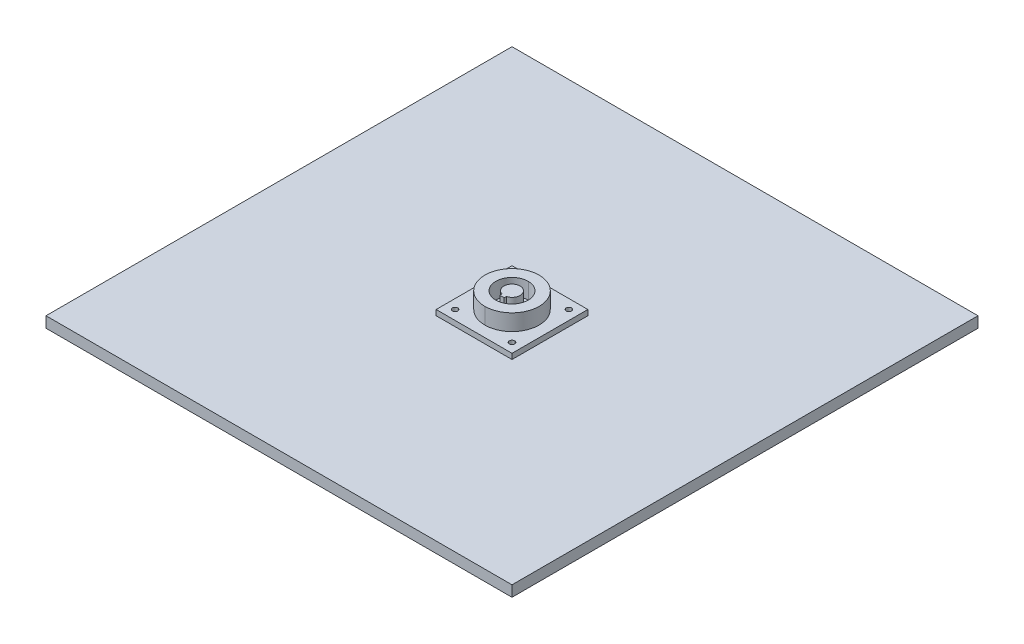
ISO-10303-21;
HEADER;
FILE_DESCRIPTION(('STEP AP214'),'2;1');
FILE_NAME('part.step','',(''),(''),'','','');
FILE_SCHEMA(('AUTOMOTIVE_DESIGN { 1 0 10303 214 1 1 1 1 }'));
ENDSEC;
DATA;
#1=APPLICATION_CONTEXT('core data for automotive mechanical design processes');
#2=APPLICATION_PROTOCOL_DEFINITION('international standard','automotive_design',2000,#1);
#3=PRODUCT_CONTEXT('',#1,'mechanical');
#4=PRODUCT('Part','Part','',(#3));
#5=PRODUCT_RELATED_PRODUCT_CATEGORY('part','',(#4));
#6=PRODUCT_DEFINITION_FORMATION('','',#4);
#7=PRODUCT_DEFINITION_CONTEXT('part definition',#1,'design');
#8=PRODUCT_DEFINITION('design','',#6,#7);
#9=PRODUCT_DEFINITION_SHAPE('','',#8);
#10=(LENGTH_UNIT() NAMED_UNIT(*) SI_UNIT(.MILLI.,.METRE.));
#11=(NAMED_UNIT(*) PLANE_ANGLE_UNIT() SI_UNIT($,.RADIAN.));
#12=(NAMED_UNIT(*) SI_UNIT($,.STERADIAN.) SOLID_ANGLE_UNIT());
#13=UNCERTAINTY_MEASURE_WITH_UNIT(LENGTH_MEASURE(1.E-05),#10,'distance_accuracy_value','');
#14=(GEOMETRIC_REPRESENTATION_CONTEXT(3) GLOBAL_UNCERTAINTY_ASSIGNED_CONTEXT((#13)) GLOBAL_UNIT_ASSIGNED_CONTEXT((#10,
#11,#12)) REPRESENTATION_CONTEXT('',''));
#15=CARTESIAN_POINT('',(0.,0.,0.));
#16=DIRECTION('',(0.,0.,1.));
#17=DIRECTION('',(1.,0.,0.));
#18=AXIS2_PLACEMENT_3D('',#15,#16,#17);
#19=CARTESIAN_POINT('',(-35.,5.,-35.));
#20=DIRECTION('',(0.,1.,0.));
#21=DIRECTION('',(0.,0.,1.));
#22=AXIS2_PLACEMENT_3D('',#19,#20,#21);
#23=PLANE('',#22);
#24=CARTESIAN_POINT('',(-35.,5.,35.));
#25=DIRECTION('',(1.,0.,0.));
#26=VECTOR('',#25,1.);
#27=LINE('',#24,#26);
#28=CARTESIAN_POINT('',(-35.,5.,35.));
#29=VERTEX_POINT('',#28);
#30=CARTESIAN_POINT('',(35.,5.,35.));
#31=VERTEX_POINT('',#30);
#32=EDGE_CURVE('E11',#29,#31,#27,.T.);
#33=ORIENTED_EDGE('',*,*,#32,.T.);
#34=CARTESIAN_POINT('',(35.,5.,35.));
#35=DIRECTION('',(0.,0.,-1.));
#36=VECTOR('',#35,1.);
#37=LINE('',#34,#36);
#38=CARTESIAN_POINT('',(35.,5.,-35.));
#39=VERTEX_POINT('',#38);
#40=EDGE_CURVE('E25',#31,#39,#37,.T.);
#41=ORIENTED_EDGE('',*,*,#40,.T.);
#42=CARTESIAN_POINT('',(-35.,5.,-35.));
#43=DIRECTION('',(1.,0.,0.));
#44=VECTOR('',#43,1.);
#45=LINE('',#42,#44);
#46=CARTESIAN_POINT('',(-35.,5.,-35.));
#47=VERTEX_POINT('',#46);
#48=EDGE_CURVE('E620',#47,#39,#45,.T.);
#49=ORIENTED_EDGE('',*,*,#48,.F.);
#50=CARTESIAN_POINT('',(-35.,5.,35.));
#51=DIRECTION('',(0.,0.,-1.));
#52=VECTOR('',#51,1.);
#53=LINE('',#50,#52);
#54=EDGE_CURVE('E617',#29,#47,#53,.T.);
#55=ORIENTED_EDGE('',*,*,#54,.F.);
#56=EDGE_LOOP('',(#33,#41,#49,#55));
#57=FACE_BOUND('',#56,.T.);
#58=CARTESIAN_POINT('',(0.,5.,0.));
#59=DIRECTION('',(0.,1.,0.));
#60=DIRECTION('',(0.,0.,-1.));
#61=AXIS2_PLACEMENT_3D('',#58,#59,#60);
#62=CIRCLE('',#61,25.);
#63=CARTESIAN_POINT('',(0.,5.,-25.));
#64=VERTEX_POINT('',#63);
#65=CARTESIAN_POINT('',(0.,5.,25.));
#66=VERTEX_POINT('',#65);
#67=EDGE_CURVE('E614',#64,#66,#62,.T.);
#68=ORIENTED_EDGE('',*,*,#67,.F.);
#69=CARTESIAN_POINT('',(0.,5.,0.));
#70=DIRECTION('',(0.,1.,0.));
#71=DIRECTION('',(0.,0.,1.));
#72=AXIS2_PLACEMENT_3D('',#69,#70,#71);
#73=CIRCLE('',#72,25.);
#74=EDGE_CURVE('E611',#66,#64,#73,.T.);
#75=ORIENTED_EDGE('',*,*,#74,.F.);
#76=EDGE_LOOP('',(#68,#75));
#77=FACE_BOUND('',#76,.T.);
#78=CARTESIAN_POINT('',(-26.2566311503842,5.,-26.2566311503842));
#79=DIRECTION('',(0.,1.,0.));
#80=DIRECTION('',(0.,0.,-1.));
#81=AXIS2_PLACEMENT_3D('',#78,#79,#80);
#82=CIRCLE('',#81,2.5);
#83=CARTESIAN_POINT('',(-26.2566311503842,5.,-28.7566311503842));
#84=VERTEX_POINT('',#83);
#85=CARTESIAN_POINT('',(-26.2566311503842,5.,-23.7566311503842));
#86=VERTEX_POINT('',#85);
#87=EDGE_CURVE('E608',#84,#86,#82,.T.);
#88=ORIENTED_EDGE('',*,*,#87,.F.);
#89=CARTESIAN_POINT('',(-26.2566311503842,5.,-26.2566311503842));
#90=DIRECTION('',(0.,1.,0.));
#91=DIRECTION('',(0.,0.,1.));
#92=AXIS2_PLACEMENT_3D('',#89,#90,#91);
#93=CIRCLE('',#92,2.5);
#94=EDGE_CURVE('E605',#86,#84,#93,.T.);
#95=ORIENTED_EDGE('',*,*,#94,.F.);
#96=EDGE_LOOP('',(#88,#95));
#97=FACE_BOUND('',#96,.T.);
#98=CARTESIAN_POINT('',(26.2566311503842,5.,-26.2566311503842));
#99=DIRECTION('',(0.,1.,0.));
#100=DIRECTION('',(0.,0.,-1.));
#101=AXIS2_PLACEMENT_3D('',#98,#99,#100);
#102=CIRCLE('',#101,2.5);
#103=CARTESIAN_POINT('',(26.2566311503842,5.,-28.7566311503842));
#104=VERTEX_POINT('',#103);
#105=CARTESIAN_POINT('',(26.2566311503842,5.,-23.7566311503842));
#106=VERTEX_POINT('',#105);
#107=EDGE_CURVE('E602',#104,#106,#102,.T.);
#108=ORIENTED_EDGE('',*,*,#107,.F.);
#109=CARTESIAN_POINT('',(26.2566311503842,5.,-26.2566311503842));
#110=DIRECTION('',(0.,1.,0.));
#111=DIRECTION('',(0.,0.,1.));
#112=AXIS2_PLACEMENT_3D('',#109,#110,#111);
#113=CIRCLE('',#112,2.5);
#114=EDGE_CURVE('E599',#106,#104,#113,.T.);
#115=ORIENTED_EDGE('',*,*,#114,.F.);
#116=EDGE_LOOP('',(#108,#115));
#117=FACE_BOUND('',#116,.T.);
#118=CARTESIAN_POINT('',(-26.2566311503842,5.,28.7566311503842));
#119=CARTESIAN_POINT('',(-26.7120474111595,5.,28.7564461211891));
#120=CARTESIAN_POINT('',(-27.1581460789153,5.,28.6325485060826));
#121=CARTESIAN_POINT('',(-27.9255362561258,5.,28.1694266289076));
#122=CARTESIAN_POINT('',(-28.2362183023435,5.,27.8457188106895));
#123=CARTESIAN_POINT('',(-28.7376288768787,5.,26.9323547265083));
#124=CARTESIAN_POINT('',(-28.8272007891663,5.,26.3184998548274));
#125=CARTESIAN_POINT('',(-28.6206181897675,5.,25.3582328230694));
#126=CARTESIAN_POINT('',(-28.4564020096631,5.,25.0092356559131));
#127=CARTESIAN_POINT('',(-27.8276854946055,5.,24.210965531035));
#128=CARTESIAN_POINT('',(-27.2598969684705,5.,23.8802386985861));
#129=CARTESIAN_POINT('',(-26.5075682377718,5.,23.766136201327));
#130=CARTESIAN_POINT('',(-26.3821872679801,5.,23.7566821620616));
#131=CARTESIAN_POINT('',(-26.2566311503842,5.,23.7566311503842));
#132=B_SPLINE_CURVE_WITH_KNOTS('',3,(#118,#119,#120,#121,#122,#123,#124,#125,#126,#127,#128,
#129,#130,#131),.UNSPECIFIED.,.F.,.F.,(4,2,2,2,2,2,4),(0.,0.172601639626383,0.339653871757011,
0.56746654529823,0.711758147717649,0.952421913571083,1.),.UNSPECIFIED.);
#133=CARTESIAN_POINT('',(-26.2566311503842,5.,28.7566311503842));
#134=VERTEX_POINT('',#133);
#135=CARTESIAN_POINT('',(-26.2566311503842,5.,23.7566311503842));
#136=VERTEX_POINT('',#135);
#137=EDGE_CURVE('E597',#134,#136,#132,.T.);
#138=ORIENTED_EDGE('',*,*,#137,.T.);
#139=CARTESIAN_POINT('',(-26.2566311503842,5.,23.7566311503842));
#140=CARTESIAN_POINT('',(-25.8012148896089,5.,23.7568161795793));
#141=CARTESIAN_POINT('',(-25.3551162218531,5.,23.8807137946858));
#142=CARTESIAN_POINT('',(-24.5877260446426,5.,24.3438356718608));
#143=CARTESIAN_POINT('',(-24.2770439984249,5.,24.667543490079));
#144=CARTESIAN_POINT('',(-23.7756334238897,5.,25.58090757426));
#145=CARTESIAN_POINT('',(-23.6860615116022,5.,26.194762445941));
#146=CARTESIAN_POINT('',(-23.8926441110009,5.,27.155029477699));
#147=CARTESIAN_POINT('',(-24.0568602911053,5.,27.5040266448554));
#148=CARTESIAN_POINT('',(-24.6855768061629,5.,28.3022967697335));
#149=CARTESIAN_POINT('',(-25.2533653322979,5.,28.6330236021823));
#150=CARTESIAN_POINT('',(-26.0056940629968,5.,28.7471260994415));
#151=CARTESIAN_POINT('',(-26.1310750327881,5.,28.7565801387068));
#152=CARTESIAN_POINT('',(-26.2566311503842,5.,28.7566311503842));
#153=B_SPLINE_CURVE_WITH_KNOTS('',3,(#139,#140,#141,#142,#143,#144,#145,#146,#147,#148,#149,
#150,#151,#152),.UNSPECIFIED.,.F.,.F.,(4,2,2,2,2,2,4),(0.,0.172601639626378,0.339653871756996,
0.567466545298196,0.711758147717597,0.952421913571,1.),.UNSPECIFIED.);
#154=EDGE_CURVE('E595',#136,#134,#153,.T.);
#155=ORIENTED_EDGE('',*,*,#154,.T.);
#156=EDGE_LOOP('',(#138,#155));
#157=FACE_BOUND('',#156,.T.);
#158=CARTESIAN_POINT('',(26.2566311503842,5.,28.7566311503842));
#159=CARTESIAN_POINT('',(25.8012148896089,5.,28.7564461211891));
#160=CARTESIAN_POINT('',(25.3551162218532,5.,28.6325485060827));
#161=CARTESIAN_POINT('',(24.5877260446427,5.,28.1694266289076));
#162=CARTESIAN_POINT('',(24.2770439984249,5.,27.8457188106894));
#163=CARTESIAN_POINT('',(23.7756334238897,5.,26.9323547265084));
#164=CARTESIAN_POINT('',(23.6860615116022,5.,26.3184998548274));
#165=CARTESIAN_POINT('',(23.892644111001,5.,25.3582328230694));
#166=CARTESIAN_POINT('',(24.0568602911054,5.,25.0092356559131));
#167=CARTESIAN_POINT('',(24.6855768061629,5.,24.2109655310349));
#168=CARTESIAN_POINT('',(25.2533653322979,5.,23.8802386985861));
#169=CARTESIAN_POINT('',(26.0056940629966,5.,23.766136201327));
#170=CARTESIAN_POINT('',(26.1310750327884,5.,23.7566821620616));
#171=CARTESIAN_POINT('',(26.2566311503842,5.,23.7566311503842));
#172=B_SPLINE_CURVE_WITH_KNOTS('',3,(#158,#159,#160,#161,#162,#163,#164,#165,#166,#167,#168,
#169,#170,#171),.UNSPECIFIED.,.F.,.F.,(4,2,2,2,2,2,4),(0.,0.172601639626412,0.339653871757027,
0.567466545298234,0.711758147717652,0.952421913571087,1.),.UNSPECIFIED.);
#173=CARTESIAN_POINT('',(26.2566311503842,5.,28.7566311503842));
#174=VERTEX_POINT('',#173);
#175=CARTESIAN_POINT('',(26.2566311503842,5.,23.7566311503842));
#176=VERTEX_POINT('',#175);
#177=EDGE_CURVE('E593',#174,#176,#172,.T.);
#178=ORIENTED_EDGE('',*,*,#177,.T.);
#179=CARTESIAN_POINT('',(26.2566311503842,5.,23.7566311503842));
#180=CARTESIAN_POINT('',(26.7120474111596,5.,23.7568161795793));
#181=CARTESIAN_POINT('',(27.1581460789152,5.,23.8807137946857));
#182=CARTESIAN_POINT('',(27.9255362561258,5.,24.3438356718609));
#183=CARTESIAN_POINT('',(28.2362183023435,5.,24.6675434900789));
#184=CARTESIAN_POINT('',(28.7376288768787,5.,25.5809075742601));
#185=CARTESIAN_POINT('',(28.8272007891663,5.,26.194762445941));
#186=CARTESIAN_POINT('',(28.6206181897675,5.,27.1550294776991));
#187=CARTESIAN_POINT('',(28.4564020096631,5.,27.5040266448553));
#188=CARTESIAN_POINT('',(27.8276854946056,5.,28.3022967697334));
#189=CARTESIAN_POINT('',(27.2598969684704,5.,28.6330236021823));
#190=CARTESIAN_POINT('',(26.5075682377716,5.,28.7471260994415));
#191=CARTESIAN_POINT('',(26.3821872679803,5.,28.7565801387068));
#192=CARTESIAN_POINT('',(26.2566311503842,5.,28.7566311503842));
#193=B_SPLINE_CURVE_WITH_KNOTS('',3,(#179,#180,#181,#182,#183,#184,#185,#186,#187,#188,#189,
#190,#191,#192),.UNSPECIFIED.,.F.,.F.,(4,2,2,2,2,2,4),(0.,0.172601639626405,0.339653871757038,
0.567466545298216,0.71175814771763,0.952421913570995,1.),.UNSPECIFIED.);
#194=EDGE_CURVE('E591',#176,#174,#193,.T.);
#195=ORIENTED_EDGE('',*,*,#194,.T.);
#196=EDGE_LOOP('',(#178,#195));
#197=FACE_BOUND('',#196,.T.);
#198=ADVANCED_FACE('F16',(#57,#77,#97,#117,#157,#197),#23,.T.);
#199=CARTESIAN_POINT('',(26.2566311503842,5.,26.2566311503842));
#200=DIRECTION('',(0.,-1.,0.));
#201=DIRECTION('',(-1.,0.,0.));
#202=AXIS2_PLACEMENT_3D('',#199,#200,#201);
#203=CYLINDRICAL_SURFACE('',#202,2.49999999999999);
#204=ORIENTED_EDGE('',*,*,#194,.F.);
#205=CARTESIAN_POINT('',(26.2566311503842,5.,23.7566311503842));
#206=DIRECTION('',(0.,-1.,0.));
#207=VECTOR('',#206,1.);
#208=LINE('',#205,#207);
#209=CARTESIAN_POINT('',(26.2566311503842,0.,23.7566311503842));
#210=VERTEX_POINT('',#209);
#211=EDGE_CURVE('E589',#176,#210,#208,.T.);
#212=ORIENTED_EDGE('',*,*,#211,.T.);
#213=CARTESIAN_POINT('',(26.2566311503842,0.,26.2566311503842));
#214=DIRECTION('',(0.,-1.,0.));
#215=DIRECTION('',(0.,0.,-1.));
#216=AXIS2_PLACEMENT_3D('',#213,#214,#215);
#217=CIRCLE('',#216,2.49999999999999);
#218=CARTESIAN_POINT('',(26.2566311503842,0.,28.7566311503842));
#219=VERTEX_POINT('',#218);
#220=EDGE_CURVE('E587',#210,#219,#217,.T.);
#221=ORIENTED_EDGE('',*,*,#220,.T.);
#222=CARTESIAN_POINT('',(26.2566311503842,0.,28.7566311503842));
#223=DIRECTION('',(0.,1.,0.));
#224=VECTOR('',#223,1.);
#225=LINE('',#222,#224);
#226=EDGE_CURVE('E584',#219,#174,#225,.T.);
#227=ORIENTED_EDGE('',*,*,#226,.T.);
#228=EDGE_LOOP('',(#204,#212,#221,#227));
#229=FACE_BOUND('',#228,.T.);
#230=ADVANCED_FACE('F1547',(#229),#203,.F.);
#231=CARTESIAN_POINT('',(26.2566311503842,5.,26.2566311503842));
#232=DIRECTION('',(0.,-1.,0.));
#233=DIRECTION('',(1.,0.,0.));
#234=AXIS2_PLACEMENT_3D('',#231,#232,#233);
#235=CYLINDRICAL_SURFACE('',#234,2.49999999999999);
#236=CARTESIAN_POINT('',(26.2566311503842,0.,26.2566311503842));
#237=DIRECTION('',(0.,-1.,0.));
#238=DIRECTION('',(0.,0.,1.));
#239=AXIS2_PLACEMENT_3D('',#236,#237,#238);
#240=CIRCLE('',#239,2.49999999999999);
#241=EDGE_CURVE('E581',#219,#210,#240,.T.);
#242=ORIENTED_EDGE('',*,*,#241,.T.);
#243=ORIENTED_EDGE('',*,*,#211,.F.);
#244=ORIENTED_EDGE('',*,*,#177,.F.);
#245=ORIENTED_EDGE('',*,*,#226,.F.);
#246=EDGE_LOOP('',(#242,#243,#244,#245));
#247=FACE_BOUND('',#246,.T.);
#248=ADVANCED_FACE('F1489',(#247),#235,.F.);
#249=CARTESIAN_POINT('',(23.6860615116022,0.,23.7566311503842));
#250=DIRECTION('',(0.,1.,0.));
#251=DIRECTION('',(0.,0.,1.));
#252=AXIS2_PLACEMENT_3D('',#249,#250,#251);
#253=PLANE('',#252);
#254=ORIENTED_EDGE('',*,*,#220,.F.);
#255=ORIENTED_EDGE('',*,*,#241,.F.);
#256=EDGE_LOOP('',(#254,#255));
#257=FACE_BOUND('',#256,.T.);
#258=ADVANCED_FACE('F1480',(#257),#253,.T.);
#259=CARTESIAN_POINT('',(-26.2566311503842,5.,26.2566311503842));
#260=DIRECTION('',(0.,-1.,0.));
#261=DIRECTION('',(-1.,0.,0.));
#262=AXIS2_PLACEMENT_3D('',#259,#260,#261);
#263=CYLINDRICAL_SURFACE('',#262,2.49999999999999);
#264=ORIENTED_EDGE('',*,*,#154,.F.);
#265=CARTESIAN_POINT('',(-26.2566311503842,5.,23.7566311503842));
#266=DIRECTION('',(0.,-1.,0.));
#267=VECTOR('',#266,1.);
#268=LINE('',#265,#267);
#269=CARTESIAN_POINT('',(-26.2566311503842,0.,23.7566311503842));
#270=VERTEX_POINT('',#269);
#271=EDGE_CURVE('E579',#136,#270,#268,.T.);
#272=ORIENTED_EDGE('',*,*,#271,.T.);
#273=CARTESIAN_POINT('',(-26.2566311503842,0.,26.2566311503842));
#274=DIRECTION('',(0.,-1.,0.));
#275=DIRECTION('',(0.,0.,-1.));
#276=AXIS2_PLACEMENT_3D('',#273,#274,#275);
#277=CIRCLE('',#276,2.49999999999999);
#278=CARTESIAN_POINT('',(-26.2566311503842,0.,28.7566311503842));
#279=VERTEX_POINT('',#278);
#280=EDGE_CURVE('E577',#270,#279,#277,.T.);
#281=ORIENTED_EDGE('',*,*,#280,.T.);
#282=CARTESIAN_POINT('',(-26.2566311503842,0.,28.7566311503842));
#283=DIRECTION('',(0.,1.,0.));
#284=VECTOR('',#283,1.);
#285=LINE('',#282,#284);
#286=EDGE_CURVE('E574',#279,#134,#285,.T.);
#287=ORIENTED_EDGE('',*,*,#286,.T.);
#288=EDGE_LOOP('',(#264,#272,#281,#287));
#289=FACE_BOUND('',#288,.T.);
#290=ADVANCED_FACE('F1428',(#289),#263,.F.);
#291=CARTESIAN_POINT('',(-26.2566311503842,5.,26.2566311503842));
#292=DIRECTION('',(0.,-1.,0.));
#293=DIRECTION('',(1.,0.,0.));
#294=AXIS2_PLACEMENT_3D('',#291,#292,#293);
#295=CYLINDRICAL_SURFACE('',#294,2.49999999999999);
#296=CARTESIAN_POINT('',(-26.2566311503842,0.,26.2566311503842));
#297=DIRECTION('',(0.,-1.,0.));
#298=DIRECTION('',(0.,0.,1.));
#299=AXIS2_PLACEMENT_3D('',#296,#297,#298);
#300=CIRCLE('',#299,2.49999999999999);
#301=EDGE_CURVE('E571',#279,#270,#300,.T.);
#302=ORIENTED_EDGE('',*,*,#301,.T.);
#303=ORIENTED_EDGE('',*,*,#271,.F.);
#304=ORIENTED_EDGE('',*,*,#137,.F.);
#305=ORIENTED_EDGE('',*,*,#286,.F.);
#306=EDGE_LOOP('',(#302,#303,#304,#305));
#307=FACE_BOUND('',#306,.T.);
#308=ADVANCED_FACE('F1419',(#307),#295,.F.);
#309=CARTESIAN_POINT('',(-28.8272007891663,0.,23.7566311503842));
#310=DIRECTION('',(0.,1.,0.));
#311=DIRECTION('',(0.,0.,1.));
#312=AXIS2_PLACEMENT_3D('',#309,#310,#311);
#313=PLANE('',#312);
#314=ORIENTED_EDGE('',*,*,#280,.F.);
#315=ORIENTED_EDGE('',*,*,#301,.F.);
#316=EDGE_LOOP('',(#314,#315));
#317=FACE_BOUND('',#316,.T.);
#318=ADVANCED_FACE('F1362',(#317),#313,.T.);
#319=CARTESIAN_POINT('',(26.2566311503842,5.,-26.2566311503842));
#320=DIRECTION('',(0.,-1.,0.));
#321=DIRECTION('',(-1.,0.,0.));
#322=AXIS2_PLACEMENT_3D('',#319,#320,#321);
#323=CYLINDRICAL_SURFACE('',#322,2.5);
#324=ORIENTED_EDGE('',*,*,#114,.T.);
#325=CARTESIAN_POINT('',(26.2566311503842,5.,-28.7566311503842));
#326=DIRECTION('',(0.,-1.,0.));
#327=VECTOR('',#326,1.);
#328=LINE('',#325,#327);
#329=CARTESIAN_POINT('',(26.2566311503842,0.,-28.7566311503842));
#330=VERTEX_POINT('',#329);
#331=EDGE_CURVE('E569',#104,#330,#328,.T.);
#332=ORIENTED_EDGE('',*,*,#331,.T.);
#333=CARTESIAN_POINT('',(26.2566311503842,0.,-23.7566311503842));
#334=CARTESIAN_POINT('',(26.7120474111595,0.,-23.7568161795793));
#335=CARTESIAN_POINT('',(27.1581460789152,0.,-23.8807137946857));
#336=CARTESIAN_POINT('',(27.9255362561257,0.,-24.3438356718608));
#337=CARTESIAN_POINT('',(28.2362183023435,0.,-24.6675434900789));
#338=CARTESIAN_POINT('',(28.7376288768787,0.,-25.58090757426));
#339=CARTESIAN_POINT('',(28.8272007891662,0.,-26.194762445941));
#340=CARTESIAN_POINT('',(28.6206181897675,0.,-27.155029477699));
#341=CARTESIAN_POINT('',(28.456402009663,0.,-27.5040266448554));
#342=CARTESIAN_POINT('',(27.8276854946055,0.,-28.3022967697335));
#343=CARTESIAN_POINT('',(27.2598969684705,0.,-28.6330236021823));
#344=CARTESIAN_POINT('',(26.5075682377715,0.,-28.7471260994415));
#345=CARTESIAN_POINT('',(26.3821872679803,0.,-28.7565801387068));
#346=CARTESIAN_POINT('',(26.2566311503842,0.,-28.7566311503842));
#347=B_SPLINE_CURVE_WITH_KNOTS('',3,(#333,#334,#335,#336,#337,#338,#339,#340,#341,#342,#343,
#344,#345,#346),.UNSPECIFIED.,.F.,.F.,(4,2,2,2,2,2,4),(0.,0.172601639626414,0.339653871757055,
0.567466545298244,0.711758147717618,0.952421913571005,1.),.UNSPECIFIED.);
#348=CARTESIAN_POINT('',(26.2566311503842,0.,-23.7566311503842));
#349=VERTEX_POINT('',#348);
#350=EDGE_CURVE('E566',#349,#330,#347,.T.);
#351=ORIENTED_EDGE('',*,*,#350,.F.);
#352=CARTESIAN_POINT('',(26.2566311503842,0.,-23.7566311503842));
#353=DIRECTION('',(0.,1.,0.));
#354=VECTOR('',#353,1.);
#355=LINE('',#352,#354);
#356=EDGE_CURVE('E563',#349,#106,#355,.T.);
#357=ORIENTED_EDGE('',*,*,#356,.T.);
#358=EDGE_LOOP('',(#324,#332,#351,#357));
#359=FACE_BOUND('',#358,.T.);
#360=ADVANCED_FACE('F1353',(#359),#323,.F.);
#361=CARTESIAN_POINT('',(26.2566311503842,5.,-26.2566311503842));
#362=DIRECTION('',(0.,-1.,0.));
#363=DIRECTION('',(1.,0.,0.));
#364=AXIS2_PLACEMENT_3D('',#361,#362,#363);
#365=CYLINDRICAL_SURFACE('',#364,2.5);
#366=CARTESIAN_POINT('',(26.2566311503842,0.,-28.7566311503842));
#367=CARTESIAN_POINT('',(25.8012148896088,0.,-28.7564461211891));
#368=CARTESIAN_POINT('',(25.3551162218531,0.,-28.6325485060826));
#369=CARTESIAN_POINT('',(24.5877260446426,0.,-28.1694266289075));
#370=CARTESIAN_POINT('',(24.2770439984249,0.,-27.8457188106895));
#371=CARTESIAN_POINT('',(23.7756334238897,0.,-26.9323547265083));
#372=CARTESIAN_POINT('',(23.6860615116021,0.,-26.3184998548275));
#373=CARTESIAN_POINT('',(23.8926441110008,0.,-25.3582328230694));
#374=CARTESIAN_POINT('',(24.0568602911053,0.,-25.009235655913));
#375=CARTESIAN_POINT('',(24.6855768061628,0.,-24.2109655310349));
#376=CARTESIAN_POINT('',(25.2533653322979,0.,-23.8802386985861));
#377=CARTESIAN_POINT('',(26.0056940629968,0.,-23.7661362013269));
#378=CARTESIAN_POINT('',(26.1310750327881,0.,-23.7566821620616));
#379=CARTESIAN_POINT('',(26.2566311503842,0.,-23.7566311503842));
#380=B_SPLINE_CURVE_WITH_KNOTS('',3,(#366,#367,#368,#369,#370,#371,#372,#373,#374,#375,#376,
#377,#378,#379),.UNSPECIFIED.,.F.,.F.,(4,2,2,2,2,2,4),(0.,0.172601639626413,0.339653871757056,
0.567466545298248,0.711758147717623,0.952421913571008,1.),.UNSPECIFIED.);
#381=EDGE_CURVE('E560',#330,#349,#380,.T.);
#382=ORIENTED_EDGE('',*,*,#381,.F.);
#383=ORIENTED_EDGE('',*,*,#331,.F.);
#384=ORIENTED_EDGE('',*,*,#107,.T.);
#385=ORIENTED_EDGE('',*,*,#356,.F.);
#386=EDGE_LOOP('',(#382,#383,#384,#385));
#387=FACE_BOUND('',#386,.T.);
#388=ADVANCED_FACE('F1295',(#387),#365,.F.);
#389=CARTESIAN_POINT('',(23.6860615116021,0.,-28.7566311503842));
#390=DIRECTION('',(0.,1.,0.));
#391=DIRECTION('',(0.,0.,1.));
#392=AXIS2_PLACEMENT_3D('',#389,#390,#391);
#393=PLANE('',#392);
#394=ORIENTED_EDGE('',*,*,#350,.T.);
#395=ORIENTED_EDGE('',*,*,#381,.T.);
#396=EDGE_LOOP('',(#394,#395));
#397=FACE_BOUND('',#396,.T.);
#398=ADVANCED_FACE('F1286',(#397),#393,.T.);
#399=CARTESIAN_POINT('',(-26.2566311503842,5.,-26.2566311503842));
#400=DIRECTION('',(0.,-1.,0.));
#401=DIRECTION('',(-1.,0.,0.));
#402=AXIS2_PLACEMENT_3D('',#399,#400,#401);
#403=CYLINDRICAL_SURFACE('',#402,2.5);
#404=ORIENTED_EDGE('',*,*,#94,.T.);
#405=CARTESIAN_POINT('',(-26.2566311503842,5.,-28.7566311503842));
#406=DIRECTION('',(0.,-1.,0.));
#407=VECTOR('',#406,1.);
#408=LINE('',#405,#407);
#409=CARTESIAN_POINT('',(-26.2566311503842,0.,-28.7566311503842));
#410=VERTEX_POINT('',#409);
#411=EDGE_CURVE('E558',#84,#410,#408,.T.);
#412=ORIENTED_EDGE('',*,*,#411,.T.);
#413=CARTESIAN_POINT('',(-26.2566311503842,0.,-23.7566311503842));
#414=CARTESIAN_POINT('',(-25.8012148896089,0.,-23.7568161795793));
#415=CARTESIAN_POINT('',(-25.3551162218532,0.,-23.8807137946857));
#416=CARTESIAN_POINT('',(-24.5877260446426,0.,-24.3438356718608));
#417=CARTESIAN_POINT('',(-24.2770439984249,0.,-24.6675434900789));
#418=CARTESIAN_POINT('',(-23.7756334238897,0.,-25.58090757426));
#419=CARTESIAN_POINT('',(-23.6860615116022,0.,-26.194762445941));
#420=CARTESIAN_POINT('',(-23.8926441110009,0.,-27.155029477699));
#421=CARTESIAN_POINT('',(-24.0568602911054,0.,-27.5040266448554));
#422=CARTESIAN_POINT('',(-24.6855768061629,0.,-28.3022967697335));
#423=CARTESIAN_POINT('',(-25.2533653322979,0.,-28.6330236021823));
#424=CARTESIAN_POINT('',(-26.0056940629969,0.,-28.7471260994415));
#425=CARTESIAN_POINT('',(-26.1310750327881,0.,-28.7565801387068));
#426=CARTESIAN_POINT('',(-26.2566311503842,0.,-28.7566311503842));
#427=B_SPLINE_CURVE_WITH_KNOTS('',3,(#413,#414,#415,#416,#417,#418,#419,#420,#421,#422,#423,
#424,#425,#426),.UNSPECIFIED.,.F.,.F.,(4,2,2,2,2,2,4),(0.,0.172601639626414,0.339653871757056,
0.567466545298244,0.711758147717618,0.952421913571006,1.),.UNSPECIFIED.);
#428=CARTESIAN_POINT('',(-26.2566311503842,0.,-23.7566311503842));
#429=VERTEX_POINT('',#428);
#430=EDGE_CURVE('E555',#429,#410,#427,.T.);
#431=ORIENTED_EDGE('',*,*,#430,.F.);
#432=CARTESIAN_POINT('',(-26.2566311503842,0.,-23.7566311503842));
#433=DIRECTION('',(0.,1.,0.));
#434=VECTOR('',#433,1.);
#435=LINE('',#432,#434);
#436=EDGE_CURVE('E552',#429,#86,#435,.T.);
#437=ORIENTED_EDGE('',*,*,#436,.T.);
#438=EDGE_LOOP('',(#404,#412,#431,#437));
#439=FACE_BOUND('',#438,.T.);
#440=ADVANCED_FACE('F1237',(#439),#403,.F.);
#441=CARTESIAN_POINT('',(-26.2566311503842,5.,-26.2566311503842));
#442=DIRECTION('',(0.,-1.,0.));
#443=DIRECTION('',(1.,0.,0.));
#444=AXIS2_PLACEMENT_3D('',#441,#442,#443);
#445=CYLINDRICAL_SURFACE('',#444,2.5);
#446=CARTESIAN_POINT('',(-26.2566311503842,0.,-28.7566311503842));
#447=CARTESIAN_POINT('',(-26.7120474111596,0.,-28.7564461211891));
#448=CARTESIAN_POINT('',(-27.1581460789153,0.,-28.6325485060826));
#449=CARTESIAN_POINT('',(-27.9255362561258,0.,-28.1694266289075));
#450=CARTESIAN_POINT('',(-28.2362183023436,0.,-27.8457188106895));
#451=CARTESIAN_POINT('',(-28.7376288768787,0.,-26.9323547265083));
#452=CARTESIAN_POINT('',(-28.8272007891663,0.,-26.3184998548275));
#453=CARTESIAN_POINT('',(-28.6206181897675,0.,-25.3582328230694));
#454=CARTESIAN_POINT('',(-28.4564020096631,0.,-25.009235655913));
#455=CARTESIAN_POINT('',(-27.8276854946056,0.,-24.2109655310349));
#456=CARTESIAN_POINT('',(-27.2598969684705,0.,-23.8802386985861));
#457=CARTESIAN_POINT('',(-26.5075682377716,0.,-23.7661362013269));
#458=CARTESIAN_POINT('',(-26.3821872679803,0.,-23.7566821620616));
#459=CARTESIAN_POINT('',(-26.2566311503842,0.,-23.7566311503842));
#460=B_SPLINE_CURVE_WITH_KNOTS('',3,(#446,#447,#448,#449,#450,#451,#452,#453,#454,#455,#456,
#457,#458,#459),.UNSPECIFIED.,.F.,.F.,(4,2,2,2,2,2,4),(0.,0.172601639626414,0.339653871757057,
0.567466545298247,0.711758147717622,0.952421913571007,1.),.UNSPECIFIED.);
#461=EDGE_CURVE('E549',#410,#429,#460,.T.);
#462=ORIENTED_EDGE('',*,*,#461,.F.);
#463=ORIENTED_EDGE('',*,*,#411,.F.);
#464=ORIENTED_EDGE('',*,*,#87,.T.);
#465=ORIENTED_EDGE('',*,*,#436,.F.);
#466=EDGE_LOOP('',(#462,#463,#464,#465));
#467=FACE_BOUND('',#466,.T.);
#468=ADVANCED_FACE('F1228',(#467),#445,.F.);
#469=CARTESIAN_POINT('',(-28.8272007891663,0.,-28.7566311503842));
#470=DIRECTION('',(0.,1.,0.));
#471=DIRECTION('',(0.,0.,1.));
#472=AXIS2_PLACEMENT_3D('',#469,#470,#471);
#473=PLANE('',#472);
#474=ORIENTED_EDGE('',*,*,#430,.T.);
#475=ORIENTED_EDGE('',*,*,#461,.T.);
#476=EDGE_LOOP('',(#474,#475));
#477=FACE_BOUND('',#476,.T.);
#478=ADVANCED_FACE('F1172',(#477),#473,.T.);
#479=CARTESIAN_POINT('',(0.,20.,0.));
#480=DIRECTION('',(0.,-1.,0.));
#481=DIRECTION('',(-1.,0.,0.));
#482=AXIS2_PLACEMENT_3D('',#479,#480,#481);
#483=CYLINDRICAL_SURFACE('',#482,25.);
#484=ORIENTED_EDGE('',*,*,#74,.T.);
#485=CARTESIAN_POINT('',(0.,20.,-25.));
#486=DIRECTION('',(0.,-1.,0.));
#487=VECTOR('',#486,1.);
#488=LINE('',#485,#487);
#489=CARTESIAN_POINT('',(0.,20.,-25.));
#490=VERTEX_POINT('',#489);
#491=EDGE_CURVE('E546',#490,#64,#488,.T.);
#492=ORIENTED_EDGE('',*,*,#491,.F.);
#493=CARTESIAN_POINT('',(0.,20.,25.));
#494=CARTESIAN_POINT('',(6.6304899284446,20.,24.9999026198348));
#495=CARTESIAN_POINT('',(12.9891747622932,20.,22.3661522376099));
#496=CARTESIAN_POINT('',(20.795524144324,20.,14.559822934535));
#497=CARTESIAN_POINT('',(23.0332057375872,20.,10.6729440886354));
#498=CARTESIAN_POINT('',(25.8643739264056,20.,0.0023601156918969));
#499=CARTESIAN_POINT('',(24.9491235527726,20.,-6.8191926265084));
#500=CARTESIAN_POINT('',(19.0705976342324,20.,-16.9437262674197));
#501=CARTESIAN_POINT('',(15.2448310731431,20.,-20.4541113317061));
#502=CARTESIAN_POINT('',(7.3198449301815,20.,-24.1864229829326));
#503=CARTESIAN_POINT('',(3.6829281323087,20.,-24.9999459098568));
#504=CARTESIAN_POINT('',(0.,20.,-25.));
#505=B_SPLINE_CURVE_WITH_KNOTS('',3,(#493,#494,#495,#496,#497,#498,#499,#500,#501,#502,#503,
#504),.UNSPECIFIED.,.F.,.F.,(4,2,2,2,2,4),(0.,0.250867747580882,0.417695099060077,
0.668562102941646,0.860652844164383,1.),.UNSPECIFIED.);
#506=CARTESIAN_POINT('',(0.,20.,25.));
#507=VERTEX_POINT('',#506);
#508=EDGE_CURVE('E543',#507,#490,#505,.T.);
#509=ORIENTED_EDGE('',*,*,#508,.F.);
#510=CARTESIAN_POINT('',(0.,5.,25.));
#511=DIRECTION('',(0.,1.,0.));
#512=VECTOR('',#511,1.);
#513=LINE('',#510,#512);
#514=EDGE_CURVE('E540',#66,#507,#513,.T.);
#515=ORIENTED_EDGE('',*,*,#514,.F.);
#516=EDGE_LOOP('',(#484,#492,#509,#515));
#517=FACE_BOUND('',#516,.T.);
#518=ADVANCED_FACE('F1163',(#517),#483,.T.);
#519=CARTESIAN_POINT('',(0.,20.,0.));
#520=DIRECTION('',(0.,-1.,0.));
#521=DIRECTION('',(1.,0.,0.));
#522=AXIS2_PLACEMENT_3D('',#519,#520,#521);
#523=CYLINDRICAL_SURFACE('',#522,25.);
#524=CARTESIAN_POINT('',(0.,20.,-25.));
#525=CARTESIAN_POINT('',(-6.6304899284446,20.,-24.9999026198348));
#526=CARTESIAN_POINT('',(-12.9891747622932,20.,-22.3661522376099));
#527=CARTESIAN_POINT('',(-20.7955241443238,20.,-14.559822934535));
#528=CARTESIAN_POINT('',(-23.0332057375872,20.,-10.6729440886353));
#529=CARTESIAN_POINT('',(-25.8643739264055,20.,-0.00236011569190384));
#530=CARTESIAN_POINT('',(-24.9491235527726,20.,6.8191926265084));
#531=CARTESIAN_POINT('',(-19.0705976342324,20.,16.9437262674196));
#532=CARTESIAN_POINT('',(-15.2448310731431,20.,20.4541113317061));
#533=CARTESIAN_POINT('',(-7.3198449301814,20.,24.1864229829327));
#534=CARTESIAN_POINT('',(-3.6829281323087,20.,24.9999459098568));
#535=CARTESIAN_POINT('',(0.,20.,25.));
#536=B_SPLINE_CURVE_WITH_KNOTS('',3,(#524,#525,#526,#527,#528,#529,#530,#531,#532,#533,#534,
#535),.UNSPECIFIED.,.F.,.F.,(4,2,2,2,2,4),(0.,0.250867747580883,0.417695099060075,
0.668562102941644,0.86065284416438,1.),.UNSPECIFIED.);
#537=EDGE_CURVE('E537',#490,#507,#536,.T.);
#538=ORIENTED_EDGE('',*,*,#537,.F.);
#539=ORIENTED_EDGE('',*,*,#491,.T.);
#540=ORIENTED_EDGE('',*,*,#67,.T.);
#541=ORIENTED_EDGE('',*,*,#514,.T.);
#542=EDGE_LOOP('',(#538,#539,#540,#541));
#543=FACE_BOUND('',#542,.T.);
#544=ADVANCED_FACE('F1120',(#543),#523,.T.);
#545=CARTESIAN_POINT('',(-25.8643739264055,20.,-25.));
#546=DIRECTION('',(0.,1.,0.));
#547=DIRECTION('',(0.,0.,1.));
#548=AXIS2_PLACEMENT_3D('',#545,#546,#547);
#549=PLANE('',#548);
#550=ORIENTED_EDGE('',*,*,#508,.T.);
#551=ORIENTED_EDGE('',*,*,#537,.T.);
#552=EDGE_LOOP('',(#550,#551));
#553=FACE_BOUND('',#552,.T.);
#554=CARTESIAN_POINT('',(0.,20.,0.));
#555=DIRECTION('',(0.,1.,0.));
#556=DIRECTION('',(0.,0.,-1.));
#557=AXIS2_PLACEMENT_3D('',#554,#555,#556);
#558=CIRCLE('',#557,15.);
#559=CARTESIAN_POINT('',(0.,20.,-15.));
#560=VERTEX_POINT('',#559);
#561=CARTESIAN_POINT('',(0.,20.,15.));
#562=VERTEX_POINT('',#561);
#563=EDGE_CURVE('E534',#560,#562,#558,.T.);
#564=ORIENTED_EDGE('',*,*,#563,.F.);
#565=CARTESIAN_POINT('',(0.,20.,0.));
#566=DIRECTION('',(0.,1.,0.));
#567=DIRECTION('',(0.,0.,1.));
#568=AXIS2_PLACEMENT_3D('',#565,#566,#567);
#569=CIRCLE('',#568,15.);
#570=EDGE_CURVE('E531',#562,#560,#569,.T.);
#571=ORIENTED_EDGE('',*,*,#570,.F.);
#572=EDGE_LOOP('',(#564,#571));
#573=FACE_BOUND('',#572,.T.);
#574=ADVANCED_FACE('F1111',(#553,#573),#549,.T.);
#575=CARTESIAN_POINT('',(0.,20.,0.));
#576=DIRECTION('',(0.,-1.,0.));
#577=DIRECTION('',(-1.,0.,0.));
#578=AXIS2_PLACEMENT_3D('',#575,#576,#577);
#579=CYLINDRICAL_SURFACE('',#578,15.);
#580=ORIENTED_EDGE('',*,*,#570,.T.);
#581=CARTESIAN_POINT('',(0.,20.,-15.));
#582=DIRECTION('',(0.,-1.,0.));
#583=VECTOR('',#582,1.);
#584=LINE('',#581,#583);
#585=CARTESIAN_POINT('',(0.,5.,-15.));
#586=VERTEX_POINT('',#585);
#587=EDGE_CURVE('E529',#560,#586,#584,.T.);
#588=ORIENTED_EDGE('',*,*,#587,.T.);
#589=CARTESIAN_POINT('',(0.,5.,0.));
#590=DIRECTION('',(0.,-1.,0.));
#591=DIRECTION('',(0.,0.,-1.));
#592=AXIS2_PLACEMENT_3D('',#589,#590,#591);
#593=CIRCLE('',#592,15.);
#594=CARTESIAN_POINT('',(0.,5.,15.));
#595=VERTEX_POINT('',#594);
#596=EDGE_CURVE('E527',#586,#595,#593,.T.);
#597=ORIENTED_EDGE('',*,*,#596,.T.);
#598=CARTESIAN_POINT('',(0.,5.,15.));
#599=DIRECTION('',(0.,1.,0.));
#600=VECTOR('',#599,1.);
#601=LINE('',#598,#600);
#602=EDGE_CURVE('E524',#595,#562,#601,.T.);
#603=ORIENTED_EDGE('',*,*,#602,.T.);
#604=EDGE_LOOP('',(#580,#588,#597,#603));
#605=FACE_BOUND('',#604,.T.);
#606=ADVANCED_FACE('F1062',(#605),#579,.F.);
#607=CARTESIAN_POINT('',(0.,20.,0.));
#608=DIRECTION('',(0.,-1.,0.));
#609=DIRECTION('',(1.,0.,0.));
#610=AXIS2_PLACEMENT_3D('',#607,#608,#609);
#611=CYLINDRICAL_SURFACE('',#610,15.);
#612=CARTESIAN_POINT('',(0.,5.,0.));
#613=DIRECTION('',(0.,-1.,0.));
#614=DIRECTION('',(0.,0.,1.));
#615=AXIS2_PLACEMENT_3D('',#612,#613,#614);
#616=CIRCLE('',#615,15.);
#617=EDGE_CURVE('E521',#595,#586,#616,.T.);
#618=ORIENTED_EDGE('',*,*,#617,.T.);
#619=ORIENTED_EDGE('',*,*,#587,.F.);
#620=ORIENTED_EDGE('',*,*,#563,.T.);
#621=ORIENTED_EDGE('',*,*,#602,.F.);
#622=EDGE_LOOP('',(#618,#619,#620,#621));
#623=FACE_BOUND('',#622,.T.);
#624=ADVANCED_FACE('F1053',(#623),#611,.F.);
#625=CARTESIAN_POINT('',(-15.5186243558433,5.,-15.));
#626=DIRECTION('',(0.,1.,0.));
#627=DIRECTION('',(0.,0.,1.));
#628=AXIS2_PLACEMENT_3D('',#625,#626,#627);
#629=PLANE('',#628);
#630=ORIENTED_EDGE('',*,*,#596,.F.);
#631=ORIENTED_EDGE('',*,*,#617,.F.);
#632=EDGE_LOOP('',(#630,#631));
#633=FACE_BOUND('',#632,.T.);
#634=CARTESIAN_POINT('',(-2.,5.,7.2284161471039));
#635=DIRECTION('',(0.,0.,1.));
#636=VECTOR('',#635,1.);
#637=LINE('',#634,#636);
#638=CARTESIAN_POINT('',(-2.00000000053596,5.,7.2284161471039));
#639=VERTEX_POINT('',#638);
#640=CARTESIAN_POINT('',(-2.,5.,9.22841614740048));
#641=VERTEX_POINT('',#640);
#642=EDGE_CURVE('E518',#639,#641,#637,.T.);
#643=ORIENTED_EDGE('',*,*,#642,.F.);
#644=CARTESIAN_POINT('',(0.,5.,0.));
#645=DIRECTION('',(0.,1.,0.));
#646=DIRECTION('',(1.3886222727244E-10,0.,-1.));
#647=AXIS2_PLACEMENT_3D('',#644,#645,#646);
#648=CIRCLE('',#647,7.5);
#649=CARTESIAN_POINT('',(1.04145973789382E-09,5.,-7.50001984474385));
#650=VERTEX_POINT('',#649);
#651=EDGE_CURVE('E515',#650,#639,#648,.T.);
#652=ORIENTED_EDGE('',*,*,#651,.F.);
#653=CARTESIAN_POINT('',(0.,5.,0.));
#654=DIRECTION('',(0.,1.,0.));
#655=DIRECTION('',(0.26666666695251,0.,0.963788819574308));
#656=AXIS2_PLACEMENT_3D('',#653,#654,#655);
#657=CIRCLE('',#656,7.5);
#658=CARTESIAN_POINT('',(2.00000000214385,5.,7.22841614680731));
#659=VERTEX_POINT('',#658);
#660=EDGE_CURVE('E512',#659,#650,#657,.T.);
#661=ORIENTED_EDGE('',*,*,#660,.F.);
#662=CARTESIAN_POINT('',(2.,5.,9.22841614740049));
#663=DIRECTION('',(0.,0.,-1.));
#664=VECTOR('',#663,1.);
#665=LINE('',#662,#664);
#666=CARTESIAN_POINT('',(2.,5.,9.22841614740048));
#667=VERTEX_POINT('',#666);
#668=EDGE_CURVE('E509',#667,#659,#665,.T.);
#669=ORIENTED_EDGE('',*,*,#668,.F.);
#670=CARTESIAN_POINT('',(-2.,5.,9.22841614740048));
#671=DIRECTION('',(1.,0.,0.));
#672=VECTOR('',#671,1.);
#673=LINE('',#670,#672);
#674=EDGE_CURVE('E506',#641,#667,#673,.T.);
#675=ORIENTED_EDGE('',*,*,#674,.F.);
#676=EDGE_LOOP('',(#643,#652,#661,#669,#675));
#677=FACE_BOUND('',#676,.T.);
#678=ADVANCED_FACE('F952',(#633,#677),#629,.T.);
#679=CARTESIAN_POINT('',(2.,5.,9.22841614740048));
#680=DIRECTION('',(0.,0.,1.));
#681=DIRECTION('',(0.,1.,0.));
#682=AXIS2_PLACEMENT_3D('',#679,#680,#681);
#683=PLANE('',#682);
#684=ORIENTED_EDGE('',*,*,#674,.T.);
#685=CARTESIAN_POINT('',(2.,20.,9.22841614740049));
#686=DIRECTION('',(0.,-1.,0.));
#687=VECTOR('',#686,1.);
#688=LINE('',#685,#687);
#689=CARTESIAN_POINT('',(2.,20.,9.22841614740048));
#690=VERTEX_POINT('',#689);
#691=EDGE_CURVE('E503',#690,#667,#688,.T.);
#692=ORIENTED_EDGE('',*,*,#691,.F.);
#693=CARTESIAN_POINT('',(-2.,20.,9.22841614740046));
#694=DIRECTION('',(1.,0.,0.));
#695=VECTOR('',#694,1.);
#696=LINE('',#693,#695);
#697=CARTESIAN_POINT('',(-2.,20.,9.22841614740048));
#698=VERTEX_POINT('',#697);
#699=EDGE_CURVE('E500',#698,#690,#696,.T.);
#700=ORIENTED_EDGE('',*,*,#699,.F.);
#701=CARTESIAN_POINT('',(-2.,20.,9.22841614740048));
#702=DIRECTION('',(0.,-1.,0.));
#703=VECTOR('',#702,1.);
#704=LINE('',#701,#703);
#705=EDGE_CURVE('E497',#698,#641,#704,.T.);
#706=ORIENTED_EDGE('',*,*,#705,.T.);
#707=EDGE_LOOP('',(#684,#692,#700,#706));
#708=FACE_BOUND('',#707,.T.);
#709=ADVANCED_FACE('F943',(#708),#683,.T.);
#710=CARTESIAN_POINT('',(-2.,5.,9.22841614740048));
#711=DIRECTION('',(-1.,0.,0.));
#712=DIRECTION('',(0.,1.,0.));
#713=AXIS2_PLACEMENT_3D('',#710,#711,#712);
#714=PLANE('',#713);
#715=ORIENTED_EDGE('',*,*,#642,.T.);
#716=ORIENTED_EDGE('',*,*,#705,.F.);
#717=CARTESIAN_POINT('',(-2.00000000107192,20.,7.22841614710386));
#718=DIRECTION('',(5.35959731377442E-10,0.,1.));
#719=VECTOR('',#718,1.);
#720=LINE('',#717,#719);
#721=CARTESIAN_POINT('',(-2.00000000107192,20.,7.22841614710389));
#722=VERTEX_POINT('',#721);
#723=EDGE_CURVE('E494',#722,#698,#720,.T.);
#724=ORIENTED_EDGE('',*,*,#723,.F.);
#725=CARTESIAN_POINT('',(-2.,20.,7.22841614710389));
#726=DIRECTION('',(0.,-1.,0.));
#727=VECTOR('',#726,1.);
#728=LINE('',#725,#727);
#729=EDGE_CURVE('E491',#722,#639,#728,.T.);
#730=ORIENTED_EDGE('',*,*,#729,.T.);
#731=EDGE_LOOP('',(#715,#716,#724,#730));
#732=FACE_BOUND('',#731,.T.);
#733=ADVANCED_FACE('F876',(#732),#714,.T.);
#734=CARTESIAN_POINT('',(0.,20.,0.));
#735=DIRECTION('',(0.,-1.,0.));
#736=DIRECTION('',(0.99090585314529,0.,0.134557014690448));
#737=AXIS2_PLACEMENT_3D('',#734,#735,#736);
#738=CYLINDRICAL_SURFACE('',#737,7.5);
#739=ORIENTED_EDGE('',*,*,#651,.T.);
#740=ORIENTED_EDGE('',*,*,#729,.F.);
#741=CARTESIAN_POINT('',(-1.43555046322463E-09,20.,-7.50001229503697));
#742=CARTESIAN_POINT('',(-0.23693377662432,20.,-7.49999858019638));
#743=CARTESIAN_POINT('',(-0.47462628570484,20.,-7.48876688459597));
#744=CARTESIAN_POINT('',(-2.4345356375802,20.,-7.30203280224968));
#745=CARTESIAN_POINT('',(-4.0459678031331,20.,-6.54735402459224));
#746=CARTESIAN_POINT('',(-6.45163684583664,20.,-4.16684373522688));
#747=CARTESIAN_POINT('',(-7.20917770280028,20.,-2.6489029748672));
#748=CARTESIAN_POINT('',(-7.59437370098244,20.,0.18836891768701));
#749=CARTESIAN_POINT('',(-7.46556972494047,20.,1.40611408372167));
#750=CARTESIAN_POINT('',(-6.58433375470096,20.,3.85058300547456));
#751=CARTESIAN_POINT('',(-5.75842374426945,20.,5.00232231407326));
#752=CARTESIAN_POINT('',(-3.88078509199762,20.,6.49690984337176));
#753=CARTESIAN_POINT('',(-2.97286391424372,20.,6.95895504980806));
#754=CARTESIAN_POINT('',(-2.00000000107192,20.,7.22841614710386));
#755=B_SPLINE_CURVE_WITH_KNOTS('',3,(#741,#742,#743,#744,#745,#746,#747,#748,#749,#750,#751,
#752,#753,#754),.UNSPECIFIED.,.F.,.F.,(4,2,2,2,2,2,4),(0.,0.0330169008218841,0.272236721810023,
0.501034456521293,0.668128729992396,0.860384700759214,1.),.UNSPECIFIED.);
#756=CARTESIAN_POINT('',(-1.43554379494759E-09,20.,-7.50001229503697));
#757=VERTEX_POINT('',#756);
#758=EDGE_CURVE('E488',#757,#722,#755,.T.);
#759=ORIENTED_EDGE('',*,*,#758,.F.);
#760=CARTESIAN_POINT('',(1.04141882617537E-09,5.,-7.5));
#761=CARTESIAN_POINT('',(9.38212615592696E-10,5.625,-7.5));
#762=CARTESIAN_POINT('',(8.35006361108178E-10,6.25,-7.5));
#763=CARTESIAN_POINT('',(6.28593713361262E-10,7.5,-7.5));
#764=CARTESIAN_POINT('',(5.25387320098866E-10,8.125,-7.5));
#765=CARTESIAN_POINT('',(3.18974343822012E-10,9.375,-7.5));
#766=CARTESIAN_POINT('',(2.15767760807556E-10,10.,-7.5));
#767=CARTESIAN_POINT('',(9.35590889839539E-12,11.25,-7.5));
#768=CARTESIAN_POINT('',(-9.38493599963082E-11,11.875,-7.5));
#769=CARTESIAN_POINT('',(-3.0026121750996E-10,13.125,-7.5));
#770=CARTESIAN_POINT('',(-4.03467806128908E-10,13.75,-7.5));
#771=CARTESIAN_POINT('',(-6.09880765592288E-10,15.,-7.5));
#772=CARTESIAN_POINT('',(-7.13087136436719E-10,15.625,-7.5));
#773=CARTESIAN_POINT('',(-9.19499845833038E-10,16.875,-7.5));
#774=CARTESIAN_POINT('',(-1.02270618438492E-09,17.5,-7.5));
#775=CARTESIAN_POINT('',(-1.22911879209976E-09,18.75,-7.5));
#776=CARTESIAN_POINT('',(-1.33232506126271E-09,19.375,-7.5));
#777=CARTESIAN_POINT('',(-1.43553127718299E-09,20.,-7.5));
#778=B_SPLINE_CURVE_WITH_KNOTS('',3,(#760,#761,#762,#763,#764,#765,#766,#767,#768,#769,#770,
#771,#772,#773,#774,#775,#776,#777),.UNSPECIFIED.,.F.,.F.,(4,2,2,2,2,2,2,2,4),(0.,1.875,3.75,
5.625,7.5,9.375,11.25,13.125,15.),.UNSPECIFIED.);
#779=EDGE_CURVE('E485',#650,#757,#778,.T.);
#780=ORIENTED_EDGE('',*,*,#779,.F.);
#781=EDGE_LOOP('',(#739,#740,#759,#780));
#782=FACE_BOUND('',#781,.T.);
#783=ADVANCED_FACE('F867',(#782),#738,.T.);
#784=CARTESIAN_POINT('',(0.,20.,0.));
#785=DIRECTION('',(0.,-1.,0.));
#786=DIRECTION('',(-0.990905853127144,0.,0.134557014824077));
#787=AXIS2_PLACEMENT_3D('',#784,#785,#786);
#788=CYLINDRICAL_SURFACE('',#787,7.5);
#789=CARTESIAN_POINT('',(2.00000000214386,20.,7.22841614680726));
#790=CARTESIAN_POINT('',(3.39395944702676,20.,6.84232119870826));
#791=CARTESIAN_POINT('',(4.64525084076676,20.,6.06342069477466));
#792=CARTESIAN_POINT('',(6.40833148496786,20.,4.07919715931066));
#793=CARTESIAN_POINT('',(6.98102287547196,20.,2.99559646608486));
#794=CARTESIAN_POINT('',(7.64134755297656,20.,0.363100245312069));
#795=CARTESIAN_POINT('',(7.55895970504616,20.,-1.17615428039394));
#796=CARTESIAN_POINT('',(6.50957963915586,20.,-4.02832389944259));
#797=CARTESIAN_POINT('',(5.55176533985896,20.,-5.26986160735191));
#798=CARTESIAN_POINT('',(3.03103249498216,20.,-7.03158400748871));
#799=CARTESIAN_POINT('',(1.53136380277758,20.,-7.50010637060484));
#800=CARTESIAN_POINT('',(-1.43555046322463E-09,20.,-7.50001229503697));
#801=B_SPLINE_CURVE_WITH_KNOTS('',3,(#789,#790,#791,#792,#793,#794,#795,#796,#797,#798,#799,
#800),.UNSPECIFIED.,.F.,.F.,(4,2,2,2,2,4),(0.,0.199917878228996,0.366841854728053,
0.575034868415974,0.786801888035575,1.),.UNSPECIFIED.);
#802=CARTESIAN_POINT('',(2.00000000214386,20.,7.22841614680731));
#803=VERTEX_POINT('',#802);
#804=EDGE_CURVE('E482',#803,#757,#801,.T.);
#805=ORIENTED_EDGE('',*,*,#804,.F.);
#806=CARTESIAN_POINT('',(2.00000000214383,20.,7.22841614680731));
#807=DIRECTION('',(0.,-1.,0.));
#808=VECTOR('',#807,1.);
#809=LINE('',#806,#808);
#810=EDGE_CURVE('E479',#803,#659,#809,.T.);
#811=ORIENTED_EDGE('',*,*,#810,.T.);
#812=ORIENTED_EDGE('',*,*,#660,.T.);
#813=ORIENTED_EDGE('',*,*,#779,.T.);
#814=EDGE_LOOP('',(#805,#811,#812,#813));
#815=FACE_BOUND('',#814,.T.);
#816=ADVANCED_FACE('F817',(#815),#788,.T.);
#817=CARTESIAN_POINT('',(2.,5.,7.22841614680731));
#818=DIRECTION('',(1.,0.,0.));
#819=DIRECTION('',(0.,1.,0.));
#820=AXIS2_PLACEMENT_3D('',#817,#818,#819);
#821=PLANE('',#820);
#822=ORIENTED_EDGE('',*,*,#668,.T.);
#823=ORIENTED_EDGE('',*,*,#810,.F.);
#824=CARTESIAN_POINT('',(2.,20.,9.22841614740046));
#825=DIRECTION('',(1.07192987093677E-09,0.,-1.));
#826=VECTOR('',#825,1.);
#827=LINE('',#824,#826);
#828=EDGE_CURVE('E476',#690,#803,#827,.T.);
#829=ORIENTED_EDGE('',*,*,#828,.F.);
#830=ORIENTED_EDGE('',*,*,#691,.T.);
#831=EDGE_LOOP('',(#822,#823,#829,#830));
#832=FACE_BOUND('',#831,.T.);
#833=ADVANCED_FACE('F808',(#832),#821,.T.);
#834=CARTESIAN_POINT('',(-7.59437370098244,20.,-7.50010637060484));
#835=DIRECTION('',(0.,1.,0.));
#836=DIRECTION('',(0.,0.,1.));
#837=AXIS2_PLACEMENT_3D('',#834,#835,#836);
#838=PLANE('',#837);
#839=ORIENTED_EDGE('',*,*,#804,.T.);
#840=ORIENTED_EDGE('',*,*,#758,.T.);
#841=ORIENTED_EDGE('',*,*,#723,.T.);
#842=ORIENTED_EDGE('',*,*,#699,.T.);
#843=ORIENTED_EDGE('',*,*,#828,.T.);
#844=EDGE_LOOP('',(#839,#840,#841,#842,#843));
#845=FACE_BOUND('',#844,.T.);
#846=ADVANCED_FACE('F696',(#845),#838,.T.);
#847=CARTESIAN_POINT('',(-35.,0.,-35.));
#848=DIRECTION('',(-1.,0.,0.));
#849=DIRECTION('',(0.,0.,1.));
#850=AXIS2_PLACEMENT_3D('',#847,#848,#849);
#851=PLANE('',#850);
#852=CARTESIAN_POINT('',(-35.,0.,35.));
#853=DIRECTION('',(0.,0.,-1.));
#854=VECTOR('',#853,1.);
#855=LINE('',#852,#854);
#856=CARTESIAN_POINT('',(-35.,0.,35.));
#857=VERTEX_POINT('',#856);
#858=CARTESIAN_POINT('',(-35.,0.,-35.));
#859=VERTEX_POINT('',#858);
#860=EDGE_CURVE('E473',#857,#859,#855,.T.);
#861=ORIENTED_EDGE('',*,*,#860,.F.);
#862=CARTESIAN_POINT('',(-35.,5.,35.));
#863=DIRECTION('',(0.,-1.,0.));
#864=VECTOR('',#863,1.);
#865=LINE('',#862,#864);
#866=EDGE_CURVE('E470',#29,#857,#865,.T.);
#867=ORIENTED_EDGE('',*,*,#866,.F.);
#868=ORIENTED_EDGE('',*,*,#54,.T.);
#869=CARTESIAN_POINT('',(-35.,5.,-35.));
#870=DIRECTION('',(0.,-1.,0.));
#871=VECTOR('',#870,1.);
#872=LINE('',#869,#871);
#873=EDGE_CURVE('E468',#47,#859,#872,.T.);
#874=ORIENTED_EDGE('',*,*,#873,.T.);
#875=EDGE_LOOP('',(#861,#867,#868,#874));
#876=FACE_BOUND('',#875,.T.);
#877=ADVANCED_FACE('F687',(#876),#851,.T.);
#878=CARTESIAN_POINT('',(35.,0.,-35.));
#879=DIRECTION('',(0.,0.,-1.));
#880=DIRECTION('',(-1.,0.,0.));
#881=AXIS2_PLACEMENT_3D('',#878,#879,#880);
#882=PLANE('',#881);
#883=CARTESIAN_POINT('',(-35.,0.,-35.));
#884=DIRECTION('',(1.,0.,0.));
#885=VECTOR('',#884,1.);
#886=LINE('',#883,#885);
#887=CARTESIAN_POINT('',(35.,0.,-35.));
#888=VERTEX_POINT('',#887);
#889=EDGE_CURVE('E465',#859,#888,#886,.T.);
#890=ORIENTED_EDGE('',*,*,#889,.F.);
#891=ORIENTED_EDGE('',*,*,#873,.F.);
#892=ORIENTED_EDGE('',*,*,#48,.T.);
#893=CARTESIAN_POINT('',(35.,5.,-35.));
#894=DIRECTION('',(0.,-1.,0.));
#895=VECTOR('',#894,1.);
#896=LINE('',#893,#895);
#897=EDGE_CURVE('E463',#39,#888,#896,.T.);
#898=ORIENTED_EDGE('',*,*,#897,.T.);
#899=EDGE_LOOP('',(#890,#891,#892,#898));
#900=FACE_BOUND('',#899,.T.);
#901=ADVANCED_FACE('F627',(#900),#882,.T.);
#902=CARTESIAN_POINT('',(35.,0.,-35.));
#903=DIRECTION('',(1.,0.,0.));
#904=DIRECTION('',(0.,1.,0.));
#905=AXIS2_PLACEMENT_3D('',#902,#903,#904);
#906=PLANE('',#905);
#907=CARTESIAN_POINT('',(35.,0.,35.));
#908=DIRECTION('',(0.,0.,-1.));
#909=VECTOR('',#908,1.);
#910=LINE('',#907,#909);
#911=CARTESIAN_POINT('',(35.,0.,35.));
#912=VERTEX_POINT('',#911);
#913=EDGE_CURVE('E460',#912,#888,#910,.T.);
#914=ORIENTED_EDGE('',*,*,#913,.T.);
#915=ORIENTED_EDGE('',*,*,#897,.F.);
#916=ORIENTED_EDGE('',*,*,#40,.F.);
#917=CARTESIAN_POINT('',(35.,5.,35.));
#918=DIRECTION('',(0.,-1.,0.));
#919=VECTOR('',#918,1.);
#920=LINE('',#917,#919);
#921=EDGE_CURVE('E458',#31,#912,#920,.T.);
#922=ORIENTED_EDGE('',*,*,#921,.T.);
#923=EDGE_LOOP('',(#914,#915,#916,#922));
#924=FACE_BOUND('',#923,.T.);
#925=ADVANCED_FACE('F635',(#924),#906,.T.);
#926=CARTESIAN_POINT('',(35.,0.,35.));
#927=DIRECTION('',(0.,0.,1.));
#928=DIRECTION('',(0.,1.,0.));
#929=AXIS2_PLACEMENT_3D('',#926,#927,#928);
#930=PLANE('',#929);
#931=CARTESIAN_POINT('',(-35.,0.,35.));
#932=DIRECTION('',(1.,0.,0.));
#933=VECTOR('',#932,1.);
#934=LINE('',#931,#933);
#935=EDGE_CURVE('E455',#857,#912,#934,.T.);
#936=ORIENTED_EDGE('',*,*,#935,.T.);
#937=ORIENTED_EDGE('',*,*,#921,.F.);
#938=ORIENTED_EDGE('',*,*,#32,.F.);
#939=ORIENTED_EDGE('',*,*,#866,.T.);
#940=EDGE_LOOP('',(#936,#937,#938,#939));
#941=FACE_BOUND('',#940,.T.);
#942=ADVANCED_FACE('F403',(#941),#930,.T.);
#943=CARTESIAN_POINT('',(-215.,0.,-215.));
#944=DIRECTION('',(0.,1.,0.));
#945=DIRECTION('',(0.,0.,1.));
#946=AXIS2_PLACEMENT_3D('',#943,#944,#945);
#947=PLANE('',#946);
#948=CARTESIAN_POINT('',(215.,0.,-215.));
#949=DIRECTION('',(0.,0.,1.));
#950=VECTOR('',#949,1.);
#951=LINE('',#948,#950);
#952=CARTESIAN_POINT('',(215.,0.,-215.));
#953=VERTEX_POINT('',#952);
#954=CARTESIAN_POINT('',(215.,0.,215.));
#955=VERTEX_POINT('',#954);
#956=EDGE_CURVE('E299',#953,#955,#951,.T.);
#957=ORIENTED_EDGE('',*,*,#956,.F.);
#958=CARTESIAN_POINT('',(-215.,0.,-215.));
#959=DIRECTION('',(1.,0.,0.));
#960=VECTOR('',#959,1.);
#961=LINE('',#958,#960);
#962=CARTESIAN_POINT('',(-215.,0.,-215.));
#963=VERTEX_POINT('',#962);
#964=EDGE_CURVE('E304',#963,#953,#961,.T.);
#965=ORIENTED_EDGE('',*,*,#964,.F.);
#966=CARTESIAN_POINT('',(-215.,0.,215.));
#967=DIRECTION('',(0.,0.,-1.));
#968=VECTOR('',#967,1.);
#969=LINE('',#966,#968);
#970=CARTESIAN_POINT('',(-215.,0.,215.));
#971=VERTEX_POINT('',#970);
#972=EDGE_CURVE('E207',#971,#963,#969,.T.);
#973=ORIENTED_EDGE('',*,*,#972,.F.);
#974=CARTESIAN_POINT('',(215.,0.,215.));
#975=DIRECTION('',(-1.,0.,0.));
#976=VECTOR('',#975,1.);
#977=LINE('',#974,#976);
#978=EDGE_CURVE('E284',#955,#971,#977,.T.);
#979=ORIENTED_EDGE('',*,*,#978,.F.);
#980=EDGE_LOOP('',(#957,#965,#973,#979));
#981=FACE_BOUND('',#980,.T.);
#982=ORIENTED_EDGE('',*,*,#935,.F.);
#983=ORIENTED_EDGE('',*,*,#860,.T.);
#984=ORIENTED_EDGE('',*,*,#889,.T.);
#985=ORIENTED_EDGE('',*,*,#913,.F.);
#986=EDGE_LOOP('',(#982,#983,#984,#985));
#987=FACE_BOUND('',#986,.T.);
#988=ADVANCED_FACE('F394',(#981,#987),#947,.T.);
#989=CARTESIAN_POINT('',(215.,-10.,215.));
#990=DIRECTION('',(0.,0.,1.));
#991=DIRECTION('',(0.,1.,0.));
#992=AXIS2_PLACEMENT_3D('',#989,#990,#991);
#993=PLANE('',#992);
#994=ORIENTED_EDGE('',*,*,#978,.T.);
#995=CARTESIAN_POINT('',(-215.,-10.,215.));
#996=DIRECTION('',(0.,1.,0.));
#997=VECTOR('',#996,1.);
#998=LINE('',#995,#997);
#999=CARTESIAN_POINT('',(-215.,-10.,215.));
#1000=VERTEX_POINT('',#999);
#1001=EDGE_CURVE('E265',#1000,#971,#998,.T.);
#1002=ORIENTED_EDGE('',*,*,#1001,.F.);
#1003=CARTESIAN_POINT('',(215.,-10.,215.));
#1004=DIRECTION('',(-1.,0.,0.));
#1005=VECTOR('',#1004,1.);
#1006=LINE('',#1003,#1005);
#1007=CARTESIAN_POINT('',(215.,-10.,215.));
#1008=VERTEX_POINT('',#1007);
#1009=EDGE_CURVE('E214',#1008,#1000,#1006,.T.);
#1010=ORIENTED_EDGE('',*,*,#1009,.F.);
#1011=CARTESIAN_POINT('',(215.,-10.,215.));
#1012=DIRECTION('',(0.,1.,0.));
#1013=VECTOR('',#1012,1.);
#1014=LINE('',#1011,#1013);
#1015=EDGE_CURVE('E288',#1008,#955,#1014,.T.);
#1016=ORIENTED_EDGE('',*,*,#1015,.T.);
#1017=EDGE_LOOP('',(#994,#1002,#1010,#1016));
#1018=FACE_BOUND('',#1017,.T.);
#1019=ADVANCED_FACE('F323',(#1018),#993,.T.);
#1020=CARTESIAN_POINT('',(215.,-10.,-215.));
#1021=DIRECTION('',(1.,0.,0.));
#1022=DIRECTION('',(0.,1.,0.));
#1023=AXIS2_PLACEMENT_3D('',#1020,#1021,#1022);
#1024=PLANE('',#1023);
#1025=ORIENTED_EDGE('',*,*,#956,.T.);
#1026=ORIENTED_EDGE('',*,*,#1015,.F.);
#1027=CARTESIAN_POINT('',(215.,-10.,-215.));
#1028=DIRECTION('',(0.,0.,1.));
#1029=VECTOR('',#1028,1.);
#1030=LINE('',#1027,#1029);
#1031=CARTESIAN_POINT('',(215.,-10.,-215.));
#1032=VERTEX_POINT('',#1031);
#1033=EDGE_CURVE('E255',#1032,#1008,#1030,.T.);
#1034=ORIENTED_EDGE('',*,*,#1033,.F.);
#1035=CARTESIAN_POINT('',(215.,-10.,-215.));
#1036=DIRECTION('',(0.,1.,0.));
#1037=VECTOR('',#1036,1.);
#1038=LINE('',#1035,#1037);
#1039=EDGE_CURVE('E190',#1032,#953,#1038,.T.);
#1040=ORIENTED_EDGE('',*,*,#1039,.T.);
#1041=EDGE_LOOP('',(#1025,#1026,#1034,#1040));
#1042=FACE_BOUND('',#1041,.T.);
#1043=ADVANCED_FACE('F298',(#1042),#1024,.T.);
#1044=CARTESIAN_POINT('',(-215.,-10.,-215.));
#1045=DIRECTION('',(0.,0.,-1.));
#1046=DIRECTION('',(0.,1.,0.));
#1047=AXIS2_PLACEMENT_3D('',#1044,#1045,#1046);
#1048=PLANE('',#1047);
#1049=ORIENTED_EDGE('',*,*,#964,.T.);
#1050=ORIENTED_EDGE('',*,*,#1039,.F.);
#1051=CARTESIAN_POINT('',(-215.,-10.,-215.));
#1052=DIRECTION('',(1.,0.,0.));
#1053=VECTOR('',#1052,1.);
#1054=LINE('',#1051,#1053);
#1055=CARTESIAN_POINT('',(-215.,-10.,-215.));
#1056=VERTEX_POINT('',#1055);
#1057=EDGE_CURVE('E181',#1056,#1032,#1054,.T.);
#1058=ORIENTED_EDGE('',*,*,#1057,.F.);
#1059=CARTESIAN_POINT('',(-215.,-10.,-215.));
#1060=DIRECTION('',(0.,1.,0.));
#1061=VECTOR('',#1060,1.);
#1062=LINE('',#1059,#1061);
#1063=EDGE_CURVE('E186',#1056,#963,#1062,.T.);
#1064=ORIENTED_EDGE('',*,*,#1063,.T.);
#1065=EDGE_LOOP('',(#1049,#1050,#1058,#1064));
#1066=FACE_BOUND('',#1065,.T.);
#1067=ADVANCED_FACE('F185',(#1066),#1048,.T.);
#1068=CARTESIAN_POINT('',(-215.,-10.,215.));
#1069=DIRECTION('',(-1.,0.,0.));
#1070=DIRECTION('',(0.,1.,0.));
#1071=AXIS2_PLACEMENT_3D('',#1068,#1069,#1070);
#1072=PLANE('',#1071);
#1073=ORIENTED_EDGE('',*,*,#972,.T.);
#1074=ORIENTED_EDGE('',*,*,#1063,.F.);
#1075=CARTESIAN_POINT('',(-215.,-10.,215.));
#1076=DIRECTION('',(0.,0.,-1.));
#1077=VECTOR('',#1076,1.);
#1078=LINE('',#1075,#1077);
#1079=EDGE_CURVE('E204',#1000,#1056,#1078,.T.);
#1080=ORIENTED_EDGE('',*,*,#1079,.F.);
#1081=ORIENTED_EDGE('',*,*,#1001,.T.);
#1082=EDGE_LOOP('',(#1073,#1074,#1080,#1081));
#1083=FACE_BOUND('',#1082,.T.);
#1084=ADVANCED_FACE('F202',(#1083),#1072,.T.);
#1085=CARTESIAN_POINT('',(-215.,-10.,-215.));
#1086=DIRECTION('',(0.,-1.,0.));
#1087=DIRECTION('',(1.,0.,0.));
#1088=AXIS2_PLACEMENT_3D('',#1085,#1086,#1087);
#1089=PLANE('',#1088);
#1090=ORIENTED_EDGE('',*,*,#1033,.T.);
#1091=ORIENTED_EDGE('',*,*,#1009,.T.);
#1092=ORIENTED_EDGE('',*,*,#1079,.T.);
#1093=ORIENTED_EDGE('',*,*,#1057,.T.);
#1094=EDGE_LOOP('',(#1090,#1091,#1092,#1093));
#1095=FACE_BOUND('',#1094,.T.);
#1096=ADVANCED_FACE('F213',(#1095),#1089,.T.);
#1097=CLOSED_SHELL('',(#198,#230,#248,#258,#290,#308,#318,#360,#388,#398,#440,#468,#478,#518,
#544,#574,#606,#624,#678,#709,#733,#783,#816,#833,#846,#877,#901,#925,#942,#988,#1019,#1043,
#1067,#1084,#1096));
#1098=MANIFOLD_SOLID_BREP('B1',#1097);
#1099=ADVANCED_BREP_SHAPE_REPRESENTATION('',(#18,#1098),#14);
#1100=SHAPE_DEFINITION_REPRESENTATION(#9,#1099);
ENDSEC;
END-ISO-10303-21;
